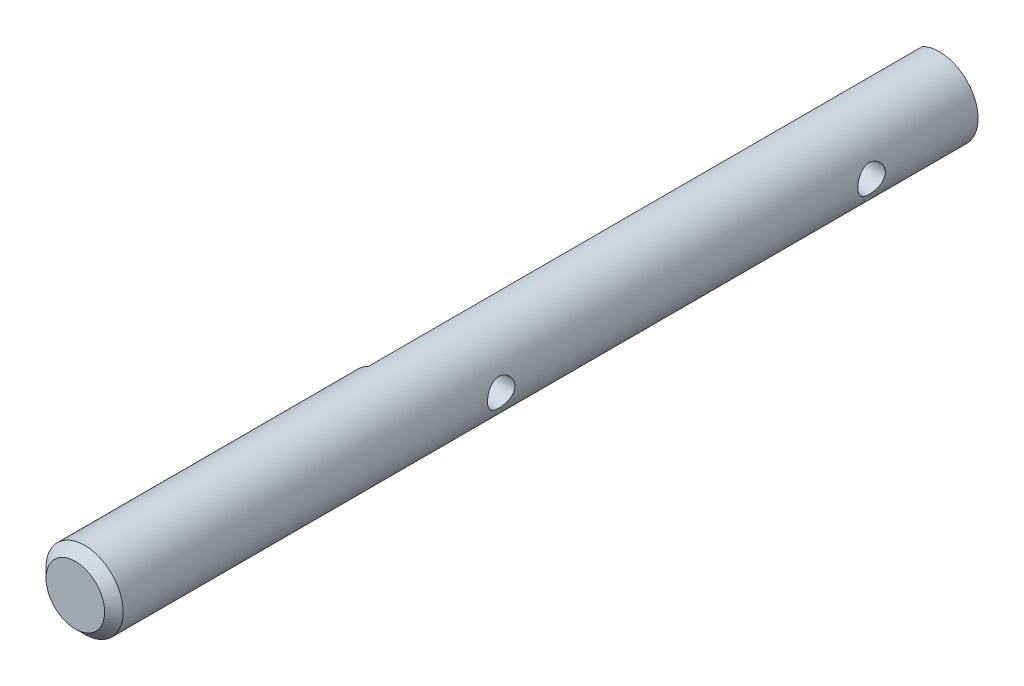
ISO-10303-21;
HEADER;
FILE_DESCRIPTION(('STEP AP214'),'2;1');
FILE_NAME('part.step','',(''),(''),'','','');
FILE_SCHEMA(('AUTOMOTIVE_DESIGN { 1 0 10303 214 1 1 1 1 }'));
ENDSEC;
DATA;
#1=APPLICATION_CONTEXT('core data for automotive mechanical design processes');
#2=APPLICATION_PROTOCOL_DEFINITION('international standard','automotive_design',2000,#1);
#3=PRODUCT_CONTEXT('',#1,'mechanical');
#4=PRODUCT('Part','Part','',(#3));
#5=PRODUCT_RELATED_PRODUCT_CATEGORY('part','',(#4));
#6=PRODUCT_DEFINITION_FORMATION('','',#4);
#7=PRODUCT_DEFINITION_CONTEXT('part definition',#1,'design');
#8=PRODUCT_DEFINITION('design','',#6,#7);
#9=PRODUCT_DEFINITION_SHAPE('','',#8);
#10=(LENGTH_UNIT() NAMED_UNIT(*) SI_UNIT(.MILLI.,.METRE.));
#11=(NAMED_UNIT(*) PLANE_ANGLE_UNIT() SI_UNIT($,.RADIAN.));
#12=(NAMED_UNIT(*) SI_UNIT($,.STERADIAN.) SOLID_ANGLE_UNIT());
#13=UNCERTAINTY_MEASURE_WITH_UNIT(LENGTH_MEASURE(1.E-05),#10,'distance_accuracy_value','');
#14=(GEOMETRIC_REPRESENTATION_CONTEXT(3) GLOBAL_UNCERTAINTY_ASSIGNED_CONTEXT((#13)) GLOBAL_UNIT_ASSIGNED_CONTEXT((#10,
#11,#12)) REPRESENTATION_CONTEXT('',''));
#15=CARTESIAN_POINT('',(0.,0.,0.));
#16=DIRECTION('',(0.,0.,1.));
#17=DIRECTION('',(1.,0.,0.));
#18=AXIS2_PLACEMENT_3D('',#15,#16,#17);
#19=CARTESIAN_POINT('',(0.,0.,160.02));
#20=DIRECTION('',(0.,0.,-1.));
#21=DIRECTION('',(-1.,0.,0.));
#22=AXIS2_PLACEMENT_3D('',#19,#20,#21);
#23=CYLINDRICAL_SURFACE('',#22,3.175);
#24=CARTESIAN_POINT('',(3.175,0.,127.0127));
#25=CARTESIAN_POINT('',(3.17500087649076,-0.0614285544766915,127.012698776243));
#26=CARTESIAN_POINT('',(3.17320130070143,-0.1228483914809,127.017723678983));
#27=CARTESIAN_POINT('',(3.1662010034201,-0.243864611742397,127.037618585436));
#28=CARTESIAN_POINT('',(3.16100038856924,-0.3034610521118,127.05248828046));
#29=CARTESIAN_POINT('',(3.14775949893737,-0.419068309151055,127.091488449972));
#30=CARTESIAN_POINT('',(3.13972436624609,-0.475085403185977,127.115602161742));
#31=CARTESIAN_POINT('',(3.12162393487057,-0.582278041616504,127.172325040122));
#32=CARTESIAN_POINT('',(3.11155815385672,-0.633452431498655,127.204936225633));
#33=CARTESIAN_POINT('',(3.09000790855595,-0.731495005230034,127.279055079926));
#34=CARTESIAN_POINT('',(3.07848610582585,-0.778149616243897,127.320834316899));
#35=CARTESIAN_POINT('',(3.055516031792,-0.863958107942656,127.411526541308));
#36=CARTESIAN_POINT('',(3.04406778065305,-0.903110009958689,127.460441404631));
#37=CARTESIAN_POINT('',(3.02211785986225,-0.974093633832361,127.566025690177));
#38=CARTESIAN_POINT('',(3.01166094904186,-1.00563502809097,127.622900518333));
#39=CARTESIAN_POINT('',(2.99345244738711,-1.0586113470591,127.7415793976));
#40=CARTESIAN_POINT('',(2.98569989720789,-1.08004985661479,127.803381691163));
#41=CARTESIAN_POINT('',(2.9741742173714,-1.11138819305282,127.927714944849));
#42=CARTESIAN_POINT('',(2.97026214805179,-1.12169236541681,127.990130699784));
#43=CARTESIAN_POINT('',(2.96645158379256,-1.13173392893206,128.115918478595));
#44=CARTESIAN_POINT('',(2.96655163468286,-1.13147514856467,128.179290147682));
#45=CARTESIAN_POINT('',(2.97063328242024,-1.12070953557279,128.301613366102));
#46=CARTESIAN_POINT('',(2.97440855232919,-1.11074743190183,128.360620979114));
#47=CARTESIAN_POINT('',(2.98507483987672,-1.08175290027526,128.476064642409));
#48=CARTESIAN_POINT('',(2.99196628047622,-1.06271924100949,128.53250034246));
#49=CARTESIAN_POINT('',(3.00822311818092,-1.01579639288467,128.642367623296));
#50=CARTESIAN_POINT('',(3.01763009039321,-0.9877566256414,128.695728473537));
#51=CARTESIAN_POINT('',(3.03784253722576,-0.923722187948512,128.797152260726));
#52=CARTESIAN_POINT('',(3.04864845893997,-0.887724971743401,128.845213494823));
#53=CARTESIAN_POINT('',(3.07123422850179,-0.806247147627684,128.937711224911));
#54=CARTESIAN_POINT('',(3.08303358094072,-0.760326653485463,128.981756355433));
#55=CARTESIAN_POINT('',(3.1057139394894,-0.661610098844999,129.061630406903));
#56=CARTESIAN_POINT('',(3.11659483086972,-0.608813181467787,129.097458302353));
#57=CARTESIAN_POINT('',(3.13639217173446,-0.496923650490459,129.160256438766));
#58=CARTESIAN_POINT('',(3.14528190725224,-0.437759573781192,129.187108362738));
#59=CARTESIAN_POINT('',(3.15989936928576,-0.315359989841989,129.23035200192));
#60=CARTESIAN_POINT('',(3.16562835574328,-0.252126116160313,129.246747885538));
#61=CARTESIAN_POINT('',(3.17306329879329,-0.126684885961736,129.26788948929));
#62=CARTESIAN_POINT('',(3.17495136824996,-0.0645771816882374,129.273163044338));
#63=CARTESIAN_POINT('',(3.17504672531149,0.059656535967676,129.273431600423));
#64=CARTESIAN_POINT('',(3.1732547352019,0.121782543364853,129.268428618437));
#65=CARTESIAN_POINT('',(3.16631168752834,0.242087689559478,129.248695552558));
#66=CARTESIAN_POINT('',(3.16127656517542,0.300329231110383,129.234300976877));
#67=CARTESIAN_POINT('',(3.14846933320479,0.413538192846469,129.19662458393));
#68=CARTESIAN_POINT('',(3.14069686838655,0.468505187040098,129.173341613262));
#69=CARTESIAN_POINT('',(3.12292068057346,0.575332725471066,129.117831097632));
#70=CARTESIAN_POINT('',(3.11286035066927,0.627062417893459,129.085370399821));
#71=CARTESIAN_POINT('',(3.09163517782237,0.724505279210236,129.012693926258));
#72=CARTESIAN_POINT('',(3.08046995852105,0.770216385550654,128.972475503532));
#73=CARTESIAN_POINT('',(3.05754963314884,0.856811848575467,128.882951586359));
#74=CARTESIAN_POINT('',(3.04579412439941,0.897320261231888,128.833281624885));
#75=CARTESIAN_POINT('',(3.02359841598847,0.969488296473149,128.727605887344));
#76=CARTESIAN_POINT('',(3.01315827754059,1.00114750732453,128.671599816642));
#77=CARTESIAN_POINT('',(2.99485112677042,1.05465477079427,128.554607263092));
#78=CARTESIAN_POINT('',(2.98698641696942,1.07649405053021,128.493616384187));
#79=CARTESIAN_POINT('',(2.97489781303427,1.10946944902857,128.36847036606));
#80=CARTESIAN_POINT('',(2.97067196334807,1.12061131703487,128.304316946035));
#81=CARTESIAN_POINT('',(2.96658222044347,1.13139068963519,128.178694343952));
#82=CARTESIAN_POINT('',(2.9664783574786,1.13166111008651,128.117286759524));
#83=CARTESIAN_POINT('',(2.97003931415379,1.1222816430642,127.995351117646));
#84=CARTESIAN_POINT('',(2.97370384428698,1.11263251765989,127.934822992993));
#85=CARTESIAN_POINT('',(2.98419839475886,1.08416089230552,127.817872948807));
#86=CARTESIAN_POINT('',(2.9909477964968,1.06557142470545,127.761386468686));
#87=CARTESIAN_POINT('',(3.00681233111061,1.01994372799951,127.652295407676));
#88=CARTESIAN_POINT('',(3.01592803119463,0.992903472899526,127.599691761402));
#89=CARTESIAN_POINT('',(3.03604854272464,0.929616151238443,127.497090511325));
#90=CARTESIAN_POINT('',(3.04712352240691,0.892986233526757,127.447342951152));
#91=CARTESIAN_POINT('',(3.06964995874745,0.812177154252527,127.354497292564));
#92=CARTESIAN_POINT('',(3.08110152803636,0.767995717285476,127.311401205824));
#93=CARTESIAN_POINT('',(3.10373428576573,0.670861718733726,127.231036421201));
#94=CARTESIAN_POINT('',(3.11487776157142,0.617595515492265,127.194134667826));
#95=CARTESIAN_POINT('',(3.13506244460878,0.505234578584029,127.129834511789));
#96=CARTESIAN_POINT('',(3.1441038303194,0.446140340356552,127.102435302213));
#97=CARTESIAN_POINT('',(3.15906443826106,0.323645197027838,127.058066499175));
#98=CARTESIAN_POINT('',(3.16497811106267,0.260236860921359,127.041115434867));
#99=CARTESIAN_POINT('',(3.17294468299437,0.131215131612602,127.018434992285));
#100=CARTESIAN_POINT('',(3.17499906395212,0.0656025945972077,127.012701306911));
#101=CARTESIAN_POINT('',(3.175,0.,127.0127));
#102=B_SPLINE_CURVE_WITH_KNOTS('',3,(#24,#25,#26,#27,#28,#29,#30,#31,#32,#33,#34,#35,#36,#37,
#38,#39,#40,#41,#42,#43,#44,#45,#46,#47,#48,#49,#50,#51,#52,#53,#54,#55,#56,#57,#58,#59,#60,#61,
#62,#63,#64,#65,#66,#67,#68,#69,#70,#71,#72,#73,#74,#75,#76,#77,#78,#79,#80,#81,#82,#83,#84,#85,
#86,#87,#88,#89,#90,#91,#92,#93,#94,#95,#96,#97,#98,#99,#100,#101),.UNSPECIFIED.,.T.,.F.,(4,2,2,
2,2,2,2,2,2,2,2,2,2,2,2,2,2,2,2,2,2,2,2,2,2,2,2,2,2,2,2,2,2,2,2,2,2,2,4),(0.,0.184043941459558,
0.368082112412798,0.551788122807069,0.735537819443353,0.925722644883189,1.11595755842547,
1.31258758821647,1.50914779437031,1.6983014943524,1.88738663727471,2.06643452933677,
2.24550673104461,2.42774410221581,2.61003985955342,2.80329006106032,2.99656436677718,
3.19229416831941,3.38794589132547,3.57408187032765,3.76018131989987,3.93997181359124,
4.11978564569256,4.30465683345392,4.48959121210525,4.6841682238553,4.87875428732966,
5.07351384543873,5.2681686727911,5.45147357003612,5.634764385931,5.81351722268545,
5.9923129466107,6.17977826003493,6.36730015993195,6.56359488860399,6.75987294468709,
6.95649809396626,7.15304773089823),.UNSPECIFIED.);
#103=CARTESIAN_POINT('',(3.175,0.,127.0127));
#104=VERTEX_POINT('',#103);
#105=EDGE_CURVE('E83',#104,#104,#102,.T.);
#106=ORIENTED_EDGE('',*,*,#105,.T.);
#107=EDGE_LOOP('',(#106));
#108=FACE_BOUND('',#107,.T.);
#109=CARTESIAN_POINT('',(3.175,0.,96.5327));
#110=CARTESIAN_POINT('',(3.17500087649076,-0.0614285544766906,96.5326987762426));
#111=CARTESIAN_POINT('',(3.17320130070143,-0.122848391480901,96.5377236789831));
#112=CARTESIAN_POINT('',(3.1662010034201,-0.243864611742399,96.5576185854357));
#113=CARTESIAN_POINT('',(3.16100038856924,-0.303461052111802,96.57248828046));
#114=CARTESIAN_POINT('',(3.14775949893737,-0.419068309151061,96.6114884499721));
#115=CARTESIAN_POINT('',(3.13972436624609,-0.475085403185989,96.6356021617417));
#116=CARTESIAN_POINT('',(3.12162393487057,-0.58227804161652,96.6923250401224));
#117=CARTESIAN_POINT('',(3.11155815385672,-0.633452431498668,96.7249362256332));
#118=CARTESIAN_POINT('',(3.09000790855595,-0.731495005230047,96.7990550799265));
#119=CARTESIAN_POINT('',(3.07848610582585,-0.778149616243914,96.8408343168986));
#120=CARTESIAN_POINT('',(3.05551603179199,-0.863958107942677,96.9315265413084));
#121=CARTESIAN_POINT('',(3.04406778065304,-0.903110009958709,96.9804414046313));
#122=CARTESIAN_POINT('',(3.02211785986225,-0.974093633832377,97.086025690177));
#123=CARTESIAN_POINT('',(3.01166094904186,-1.00563502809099,97.1429005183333));
#124=CARTESIAN_POINT('',(2.9934524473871,-1.05861134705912,97.2615793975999));
#125=CARTESIAN_POINT('',(2.98569989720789,-1.08004985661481,97.3233816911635));
#126=CARTESIAN_POINT('',(2.97417421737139,-1.11138819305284,97.4477149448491));
#127=CARTESIAN_POINT('',(2.97026214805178,-1.12169236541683,97.5101306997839));
#128=CARTESIAN_POINT('',(2.96645158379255,-1.13173392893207,97.6359184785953));
#129=CARTESIAN_POINT('',(2.96655163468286,-1.13147514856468,97.6992901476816));
#130=CARTESIAN_POINT('',(2.97063328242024,-1.1207095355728,97.8216133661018));
#131=CARTESIAN_POINT('',(2.97440855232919,-1.11074743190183,97.8806209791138));
#132=CARTESIAN_POINT('',(2.98507483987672,-1.08175290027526,97.9960646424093));
#133=CARTESIAN_POINT('',(2.99196628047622,-1.06271924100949,98.0525003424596));
#134=CARTESIAN_POINT('',(3.00822311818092,-1.01579639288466,98.162367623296));
#135=CARTESIAN_POINT('',(3.01763009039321,-0.987756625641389,98.2157284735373));
#136=CARTESIAN_POINT('',(3.03784253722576,-0.9237221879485,98.317152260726));
#137=CARTESIAN_POINT('',(3.04864845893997,-0.887724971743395,98.3652134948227));
#138=CARTESIAN_POINT('',(3.07123422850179,-0.806247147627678,98.4577112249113));
#139=CARTESIAN_POINT('',(3.08303358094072,-0.760326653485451,98.5017563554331));
#140=CARTESIAN_POINT('',(3.10571393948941,-0.661610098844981,98.581630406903));
#141=CARTESIAN_POINT('',(3.11659483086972,-0.608813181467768,98.617458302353));
#142=CARTESIAN_POINT('',(3.13639217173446,-0.49692365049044,98.6802564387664));
#143=CARTESIAN_POINT('',(3.14528190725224,-0.437759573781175,98.7071083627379));
#144=CARTESIAN_POINT('',(3.15989936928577,-0.315359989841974,98.7503520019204));
#145=CARTESIAN_POINT('',(3.16562835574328,-0.252126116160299,98.7667478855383));
#146=CARTESIAN_POINT('',(3.17306329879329,-0.126684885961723,98.7878894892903));
#147=CARTESIAN_POINT('',(3.17495136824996,-0.0645771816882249,98.7931630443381));
#148=CARTESIAN_POINT('',(3.17504672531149,0.0596565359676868,98.7934316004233));
#149=CARTESIAN_POINT('',(3.1732547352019,0.121782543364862,98.7884286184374));
#150=CARTESIAN_POINT('',(3.16631168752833,0.242087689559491,98.7686955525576));
#151=CARTESIAN_POINT('',(3.16127656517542,0.300329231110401,98.7543009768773));
#152=CARTESIAN_POINT('',(3.14846933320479,0.41353819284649,98.71662458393));
#153=CARTESIAN_POINT('',(3.14069686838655,0.468505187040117,98.6933416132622));
#154=CARTESIAN_POINT('',(3.12292068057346,0.57533272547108,98.6378310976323));
#155=CARTESIAN_POINT('',(3.11286035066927,0.627062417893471,98.605370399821));
#156=CARTESIAN_POINT('',(3.09163517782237,0.724505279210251,98.5326939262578));
#157=CARTESIAN_POINT('',(3.08046995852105,0.770216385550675,98.4924755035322));
#158=CARTESIAN_POINT('',(3.05754963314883,0.85681184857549,98.402951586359));
#159=CARTESIAN_POINT('',(3.0457941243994,0.897320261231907,98.3532816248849));
#160=CARTESIAN_POINT('',(3.02359841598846,0.969488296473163,98.2476058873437));
#161=CARTESIAN_POINT('',(3.01315827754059,1.00114750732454,98.191599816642));
#162=CARTESIAN_POINT('',(2.99485112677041,1.05465477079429,98.0746072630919));
#163=CARTESIAN_POINT('',(2.98698641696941,1.07649405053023,98.0136163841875));
#164=CARTESIAN_POINT('',(2.97489781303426,1.10946944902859,97.8884703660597));
#165=CARTESIAN_POINT('',(2.97067196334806,1.12061131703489,97.8243169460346));
#166=CARTESIAN_POINT('',(2.96658222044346,1.1313906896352,97.6986943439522));
#167=CARTESIAN_POINT('',(2.9664783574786,1.13166111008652,97.6372867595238));
#168=CARTESIAN_POINT('',(2.97003931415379,1.12228164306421,97.5153511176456));
#169=CARTESIAN_POINT('',(2.97370384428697,1.1126325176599,97.4548229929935));
#170=CARTESIAN_POINT('',(2.98419839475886,1.08416089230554,97.3378729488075));
#171=CARTESIAN_POINT('',(2.9909477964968,1.06557142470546,97.2813864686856));
#172=CARTESIAN_POINT('',(3.0068123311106,1.01994372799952,97.172295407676));
#173=CARTESIAN_POINT('',(3.01592803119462,0.992903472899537,97.1196917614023));
#174=CARTESIAN_POINT('',(3.03604854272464,0.929616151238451,97.0170905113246));
#175=CARTESIAN_POINT('',(3.0471235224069,0.892986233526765,96.9673429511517));
#176=CARTESIAN_POINT('',(3.06964995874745,0.812177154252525,96.8744972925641));
#177=CARTESIAN_POINT('',(3.08110152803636,0.767995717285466,96.8314012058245));
#178=CARTESIAN_POINT('',(3.10373428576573,0.670861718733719,96.7510364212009));
#179=CARTESIAN_POINT('',(3.11487776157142,0.617595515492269,96.714134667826));
#180=CARTESIAN_POINT('',(3.13506244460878,0.505234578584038,96.6498345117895));
#181=CARTESIAN_POINT('',(3.1441038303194,0.446140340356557,96.6224353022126));
#182=CARTESIAN_POINT('',(3.15906443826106,0.323645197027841,96.5780664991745));
#183=CARTESIAN_POINT('',(3.16497811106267,0.260236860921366,96.5611154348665));
#184=CARTESIAN_POINT('',(3.17294468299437,0.13121513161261,96.5384349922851));
#185=CARTESIAN_POINT('',(3.17499906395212,0.0656025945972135,96.5327013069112));
#186=CARTESIAN_POINT('',(3.175,0.,96.5327));
#187=B_SPLINE_CURVE_WITH_KNOTS('',3,(#109,#110,#111,#112,#113,#114,#115,#116,#117,#118,#119,
#120,#121,#122,#123,#124,#125,#126,#127,#128,#129,#130,#131,#132,#133,#134,#135,#136,#137,#138,
#139,#140,#141,#142,#143,#144,#145,#146,#147,#148,#149,#150,#151,#152,#153,#154,#155,#156,#157,
#158,#159,#160,#161,#162,#163,#164,#165,#166,#167,#168,#169,#170,#171,#172,#173,#174,#175,#176,
#177,#178,#179,#180,#181,#182,#183,#184,#185,#186),.UNSPECIFIED.,.T.,.F.,(4,2,2,2,2,2,2,2,2,2,2,
2,2,2,2,2,2,2,2,2,2,2,2,2,2,2,2,2,2,2,2,2,2,2,2,2,2,2,4),(0.,0.184043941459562,
0.368082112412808,0.551788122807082,0.735537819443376,0.925722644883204,1.1159575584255,
1.31258758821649,1.50914779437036,1.69830149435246,1.88738663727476,2.06643452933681,
2.24550673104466,2.42774410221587,2.61003985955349,2.80329006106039,2.99656436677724,
3.19229416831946,3.38794589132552,3.5740818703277,3.76018131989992,3.9399718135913,
4.11978564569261,4.30465683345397,4.48959121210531,4.68416822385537,4.87875428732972,
5.07351384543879,5.26816867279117,5.45147357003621,5.63476438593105,5.81351722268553,
5.99231294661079,6.17977826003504,6.36730015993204,6.56359488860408,6.75987294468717,
6.95649809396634,7.15304773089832),.UNSPECIFIED.);
#188=CARTESIAN_POINT('',(3.175,0.,96.5327));
#189=VERTEX_POINT('',#188);
#190=EDGE_CURVE('E77',#189,#189,#187,.T.);
#191=ORIENTED_EDGE('',*,*,#190,.T.);
#192=EDGE_LOOP('',(#191));
#193=FACE_BOUND('',#192,.T.);
#194=CARTESIAN_POINT('',(0.,0.,159.258));
#195=DIRECTION('',(0.,0.,1.));
#196=DIRECTION('',(1.,0.,0.));
#197=AXIS2_PLACEMENT_3D('',#194,#195,#196);
#198=CIRCLE('',#197,3.175);
#199=CARTESIAN_POINT('',(-3.17500000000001,0.,159.258));
#200=VERTEX_POINT('',#199);
#201=EDGE_CURVE('E66',#200,#200,#198,.F.);
#202=ORIENTED_EDGE('',*,*,#201,.T.);
#203=EDGE_LOOP('',(#202));
#204=FACE_BOUND('',#203,.T.);
#205=CARTESIAN_POINT('',(0.,0.,88.9));
#206=DIRECTION('',(0.,0.,-1.));
#207=DIRECTION('',(-1.,0.,0.));
#208=AXIS2_PLACEMENT_3D('',#205,#206,#207);
#209=CIRCLE('',#208,3.175);
#210=CARTESIAN_POINT('',(-1.397,2.85114292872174,88.9));
#211=VERTEX_POINT('',#210);
#212=CARTESIAN_POINT('',(-1.397,-2.85114292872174,88.9));
#213=VERTEX_POINT('',#212);
#214=EDGE_CURVE('E45',#211,#213,#209,.T.);
#215=ORIENTED_EDGE('',*,*,#214,.F.);
#216=DIRECTION('',(0.,0.,-1.));
#217=VECTOR('',#216,1.);
#218=CARTESIAN_POINT('',(-1.397,2.85114292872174,160.02));
#219=LINE('',#218,#217);
#220=CARTESIAN_POINT('',(-1.397,2.85114292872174,134.493));
#221=VERTEX_POINT('',#220);
#222=EDGE_CURVE('E62',#221,#211,#219,.T.);
#223=ORIENTED_EDGE('',*,*,#222,.F.);
#224=CARTESIAN_POINT('',(0.,0.,134.493));
#225=DIRECTION('',(0.,0.,-1.));
#226=DIRECTION('',(-1.,0.,0.));
#227=AXIS2_PLACEMENT_3D('',#224,#225,#226);
#228=CIRCLE('',#227,3.175);
#229=CARTESIAN_POINT('',(-1.397,-2.85114292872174,134.493));
#230=VERTEX_POINT('',#229);
#231=EDGE_CURVE('E39',#230,#221,#228,.T.);
#232=ORIENTED_EDGE('',*,*,#231,.F.);
#233=DIRECTION('',(0.,0.,-1.));
#234=VECTOR('',#233,1.);
#235=CARTESIAN_POINT('',(-1.397,-2.85114292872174,160.02));
#236=LINE('',#235,#234);
#237=EDGE_CURVE('E51',#213,#230,#236,.F.);
#238=ORIENTED_EDGE('',*,*,#237,.F.);
#239=EDGE_LOOP('',(#215,#223,#232,#238));
#240=FACE_BOUND('',#239,.T.);
#241=ADVANCED_FACE('F31',(#108,#193,#204,#240),#23,.T.);
#242=CARTESIAN_POINT('',(-1.397,-3.175,7.493));
#243=DIRECTION('',(-1.,0.,0.));
#244=DIRECTION('',(0.,0.,1.));
#245=AXIS2_PLACEMENT_3D('',#242,#243,#244);
#246=PLANE('',#245);
#247=CARTESIAN_POINT('',(-1.397,0.,128.143));
#248=DIRECTION('',(-1.,0.,0.));
#249=DIRECTION('',(0.,0.,1.));
#250=AXIS2_PLACEMENT_3D('',#247,#248,#249);
#251=CIRCLE('',#250,1.13029999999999);
#252=CARTESIAN_POINT('',(-1.397,0.,129.2733));
#253=VERTEX_POINT('',#252);
#254=EDGE_CURVE('E127',#253,#253,#251,.F.);
#255=ORIENTED_EDGE('',*,*,#254,.T.);
#256=EDGE_LOOP('',(#255));
#257=FACE_BOUND('',#256,.T.);
#258=CARTESIAN_POINT('',(-1.397,0.,97.663));
#259=DIRECTION('',(-1.,0.,0.));
#260=DIRECTION('',(0.,0.,1.));
#261=AXIS2_PLACEMENT_3D('',#258,#259,#260);
#262=CIRCLE('',#261,1.1303);
#263=CARTESIAN_POINT('',(-1.397,0.,98.7933));
#264=VERTEX_POINT('',#263);
#265=EDGE_CURVE('E71',#264,#264,#262,.F.);
#266=ORIENTED_EDGE('',*,*,#265,.T.);
#267=EDGE_LOOP('',(#266));
#268=FACE_BOUND('',#267,.T.);
#269=ORIENTED_EDGE('',*,*,#222,.T.);
#270=DIRECTION('',(0.,-1.,0.));
#271=VECTOR('',#270,1.);
#272=CARTESIAN_POINT('',(-1.397,-3.175,88.9));
#273=LINE('',#272,#271);
#274=EDGE_CURVE('E11',#211,#213,#273,.T.);
#275=ORIENTED_EDGE('',*,*,#274,.T.);
#276=ORIENTED_EDGE('',*,*,#237,.T.);
#277=DIRECTION('',(0.,-1.,0.));
#278=VECTOR('',#277,1.);
#279=CARTESIAN_POINT('',(-1.397,3.175,134.493));
#280=LINE('',#279,#278);
#281=EDGE_CURVE('E63',#221,#230,#280,.T.);
#282=ORIENTED_EDGE('',*,*,#281,.F.);
#283=EDGE_LOOP('',(#269,#275,#276,#282));
#284=FACE_BOUND('',#283,.T.);
#285=ADVANCED_FACE('F65',(#257,#268,#284),#246,.T.);
#286=CARTESIAN_POINT('',(-3.175,0.,97.663));
#287=DIRECTION('',(1.,0.,0.));
#288=DIRECTION('',(0.,0.,-1.));
#289=AXIS2_PLACEMENT_3D('',#286,#287,#288);
#290=CYLINDRICAL_SURFACE('',#289,1.1303);
#291=ORIENTED_EDGE('',*,*,#190,.F.);
#292=EDGE_LOOP('',(#291));
#293=FACE_BOUND('',#292,.T.);
#294=ORIENTED_EDGE('',*,*,#265,.F.);
#295=EDGE_LOOP('',(#294));
#296=FACE_BOUND('',#295,.T.);
#297=ADVANCED_FACE('F90',(#293,#296),#290,.F.);
#298=CARTESIAN_POINT('',(-3.175,0.,128.143));
#299=DIRECTION('',(1.,0.,0.));
#300=DIRECTION('',(0.,0.,-1.));
#301=AXIS2_PLACEMENT_3D('',#298,#299,#300);
#302=CYLINDRICAL_SURFACE('',#301,1.13029999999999);
#303=ORIENTED_EDGE('',*,*,#105,.F.);
#304=EDGE_LOOP('',(#303));
#305=FACE_BOUND('',#304,.T.);
#306=ORIENTED_EDGE('',*,*,#254,.F.);
#307=EDGE_LOOP('',(#306));
#308=FACE_BOUND('',#307,.T.);
#309=ADVANCED_FACE('F93',(#305,#308),#302,.F.);
#310=CARTESIAN_POINT('',(0.,0.,160.02));
#311=DIRECTION('',(0.,0.,1.));
#312=DIRECTION('',(1.,0.,0.));
#313=AXIS2_PLACEMENT_3D('',#310,#311,#312);
#314=PLANE('',#313);
#315=CARTESIAN_POINT('',(0.,0.,160.02));
#316=DIRECTION('',(0.,0.,1.));
#317=DIRECTION('',(1.,0.,0.));
#318=AXIS2_PLACEMENT_3D('',#315,#316,#317);
#319=CIRCLE('',#318,2.41299999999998);
#320=CARTESIAN_POINT('',(-2.413,0.,160.02));
#321=VERTEX_POINT('',#320);
#322=EDGE_CURVE('E69',#321,#321,#319,.T.);
#323=ORIENTED_EDGE('',*,*,#322,.T.);
#324=EDGE_LOOP('',(#323));
#325=FACE_BOUND('',#324,.T.);
#326=ADVANCED_FACE('F97',(#325),#314,.T.);
#327=CARTESIAN_POINT('',(0.,0.,160.02));
#328=DIRECTION('',(0.,0.,-1.));
#329=DIRECTION('',(-1.,0.,0.));
#330=AXIS2_PLACEMENT_3D('',#327,#328,#329);
#331=CONICAL_SURFACE('',#330,2.41299999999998,0.78539816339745);
#332=CARTESIAN_POINT('',(-3.17500000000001,0.,159.258));
#333=CARTESIAN_POINT('',(-3.16706250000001,0.,159.2659375));
#334=CARTESIAN_POINT('',(-3.15912500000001,0.,159.273875));
#335=CARTESIAN_POINT('',(-3.14325000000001,0.,159.28975));
#336=CARTESIAN_POINT('',(-3.13531250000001,0.,159.2976875));
#337=CARTESIAN_POINT('',(-3.11943750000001,0.,159.3135625));
#338=CARTESIAN_POINT('',(-3.11150000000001,0.,159.3215));
#339=CARTESIAN_POINT('',(-3.09562500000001,0.,159.337375));
#340=CARTESIAN_POINT('',(-3.08768750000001,0.,159.3453125));
#341=CARTESIAN_POINT('',(-3.07181250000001,0.,159.3611875));
#342=CARTESIAN_POINT('',(-3.06387500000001,0.,159.369125));
#343=CARTESIAN_POINT('',(-3.04800000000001,0.,159.385));
#344=CARTESIAN_POINT('',(-3.04006250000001,0.,159.3929375));
#345=CARTESIAN_POINT('',(-3.02418750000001,0.,159.4088125));
#346=CARTESIAN_POINT('',(-3.01625000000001,0.,159.41675));
#347=CARTESIAN_POINT('',(-3.00037500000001,0.,159.432625));
#348=CARTESIAN_POINT('',(-2.99243750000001,0.,159.4405625));
#349=CARTESIAN_POINT('',(-2.97656250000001,0.,159.4564375));
#350=CARTESIAN_POINT('',(-2.96862500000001,0.,159.464375));
#351=CARTESIAN_POINT('',(-2.95275000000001,0.,159.48025));
#352=CARTESIAN_POINT('',(-2.94481250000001,0.,159.4881875));
#353=CARTESIAN_POINT('',(-2.92893750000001,0.,159.5040625));
#354=CARTESIAN_POINT('',(-2.92100000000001,0.,159.512));
#355=CARTESIAN_POINT('',(-2.90512500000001,0.,159.527875));
#356=CARTESIAN_POINT('',(-2.89718750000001,0.,159.5358125));
#357=CARTESIAN_POINT('',(-2.88131250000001,0.,159.5516875));
#358=CARTESIAN_POINT('',(-2.87337500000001,0.,159.559625));
#359=CARTESIAN_POINT('',(-2.85750000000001,0.,159.5755));
#360=CARTESIAN_POINT('',(-2.84956250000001,0.,159.5834375));
#361=CARTESIAN_POINT('',(-2.83368750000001,0.,159.5993125));
#362=CARTESIAN_POINT('',(-2.82575000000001,0.,159.60725));
#363=CARTESIAN_POINT('',(-2.80987500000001,0.,159.623125));
#364=CARTESIAN_POINT('',(-2.80193750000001,0.,159.6310625));
#365=CARTESIAN_POINT('',(-2.78606250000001,0.,159.6469375));
#366=CARTESIAN_POINT('',(-2.77812500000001,0.,159.654875));
#367=CARTESIAN_POINT('',(-2.76225000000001,0.,159.67075));
#368=CARTESIAN_POINT('',(-2.75431250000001,0.,159.6786875));
#369=CARTESIAN_POINT('',(-2.73843750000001,0.,159.6945625));
#370=CARTESIAN_POINT('',(-2.7305,0.,159.7025));
#371=CARTESIAN_POINT('',(-2.714625,0.,159.718375));
#372=CARTESIAN_POINT('',(-2.70668750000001,0.,159.7263125));
#373=CARTESIAN_POINT('',(-2.6908125,0.,159.7421875));
#374=CARTESIAN_POINT('',(-2.682875,0.,159.750125));
#375=CARTESIAN_POINT('',(-2.667,0.,159.766));
#376=CARTESIAN_POINT('',(-2.6590625,0.,159.7739375));
#377=CARTESIAN_POINT('',(-2.64318750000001,0.,159.7898125));
#378=CARTESIAN_POINT('',(-2.63525,0.,159.79775));
#379=CARTESIAN_POINT('',(-2.619375,0.,159.813625));
#380=CARTESIAN_POINT('',(-2.6114375,0.,159.8215625));
#381=CARTESIAN_POINT('',(-2.5955625,0.,159.8374375));
#382=CARTESIAN_POINT('',(-2.587625,0.,159.845375));
#383=CARTESIAN_POINT('',(-2.57175,0.,159.86125));
#384=CARTESIAN_POINT('',(-2.5638125,0.,159.8691875));
#385=CARTESIAN_POINT('',(-2.5479375,0.,159.8850625));
#386=CARTESIAN_POINT('',(-2.54,0.,159.893));
#387=CARTESIAN_POINT('',(-2.524125,0.,159.908875));
#388=CARTESIAN_POINT('',(-2.5161875,0.,159.9168125));
#389=CARTESIAN_POINT('',(-2.5003125,0.,159.9326875));
#390=CARTESIAN_POINT('',(-2.492375,0.,159.940625));
#391=CARTESIAN_POINT('',(-2.4765,0.,159.9565));
#392=CARTESIAN_POINT('',(-2.4685625,0.,159.9644375));
#393=CARTESIAN_POINT('',(-2.4526875,0.,159.9803125));
#394=CARTESIAN_POINT('',(-2.44475,0.,159.98825));
#395=CARTESIAN_POINT('',(-2.428875,0.,160.004125));
#396=CARTESIAN_POINT('',(-2.42093749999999,0.,160.0120625));
#397=CARTESIAN_POINT('',(-2.413,0.,160.02));
#398=B_SPLINE_CURVE_WITH_KNOTS('',3,(#332,#333,#334,#335,#336,#337,#338,#339,#340,#341,#342,
#343,#344,#345,#346,#347,#348,#349,#350,#351,#352,#353,#354,#355,#356,#357,#358,#359,#360,#361,
#362,#363,#364,#365,#366,#367,#368,#369,#370,#371,#372,#373,#374,#375,#376,#377,#378,#379,#380,
#381,#382,#383,#384,#385,#386,#387,#388,#389,#390,#391,#392,#393,#394,#395,#396,#397),
.UNSPECIFIED.,.F.,.F.,(4,2,2,2,2,2,2,2,2,2,2,2,2,2,2,2,2,2,2,2,2,2,2,2,2,2,2,2,2,2,2,2,4),(0.,
0.033675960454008,0.0673519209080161,0.101027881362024,0.134703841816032,0.168379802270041,
0.202055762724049,0.235731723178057,0.269407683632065,0.303083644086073,0.336759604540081,
0.370435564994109,0.404111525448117,0.437787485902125,0.471463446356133,0.505139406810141,
0.538815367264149,0.572491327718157,0.606167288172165,0.639843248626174,0.673519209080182,
0.70719516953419,0.740871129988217,0.774547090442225,0.808223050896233,0.841899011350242,
0.87557497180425,0.909250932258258,0.942926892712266,0.976602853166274,1.01027881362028,
1.04395477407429,1.07763073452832),.UNSPECIFIED.);
#399=EDGE_CURVE('BSEAM33',#200,#321,#398,.T.);
#400=ORIENTED_EDGE('',*,*,#201,.F.);
#401=ORIENTED_EDGE('',*,*,#322,.F.);
#402=ORIENTED_EDGE('',*,*,#399,.T.);
#403=ORIENTED_EDGE('',*,*,#399,.F.);
#404=EDGE_LOOP('',(#400,#402,#401,#403));
#405=FACE_BOUND('',#404,.T.);
#406=ADVANCED_FACE('F33',(#405),#331,.T.);
#407=CARTESIAN_POINT('',(-1.397,3.175,134.493));
#408=DIRECTION('',(0.,0.,-1.));
#409=DIRECTION('',(-1.,0.,0.));
#410=AXIS2_PLACEMENT_3D('',#407,#408,#409);
#411=PLANE('',#410);
#412=ORIENTED_EDGE('',*,*,#231,.T.);
#413=ORIENTED_EDGE('',*,*,#281,.T.);
#414=EDGE_LOOP('',(#412,#413));
#415=FACE_BOUND('',#414,.T.);
#416=ADVANCED_FACE('F104',(#415),#411,.T.);
#417=CARTESIAN_POINT('',(0.,0.,88.9));
#418=DIRECTION('',(0.,0.,-1.));
#419=DIRECTION('',(-1.,0.,0.));
#420=AXIS2_PLACEMENT_3D('',#417,#418,#419);
#421=PLANE('',#420);
#422=ORIENTED_EDGE('',*,*,#214,.T.);
#423=ORIENTED_EDGE('',*,*,#274,.F.);
#424=EDGE_LOOP('',(#422,#423));
#425=FACE_BOUND('',#424,.T.);
#426=ADVANCED_FACE('F57',(#425),#421,.T.);
#427=CLOSED_SHELL('',(#241,#285,#297,#309,#326,#406,#416,#426));
#428=MANIFOLD_SOLID_BREP('B2',#427);
#429=ADVANCED_BREP_SHAPE_REPRESENTATION('',(#18,#428),#14);
#430=SHAPE_DEFINITION_REPRESENTATION(#9,#429);
ENDSEC;
END-ISO-10303-21;
